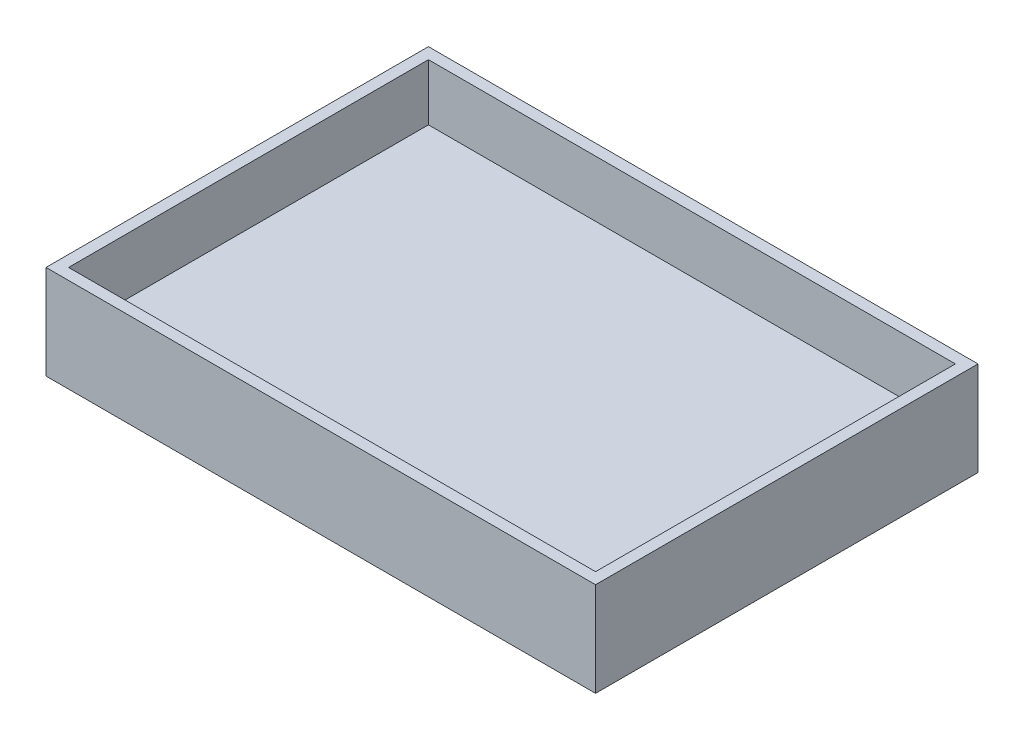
from build123d import *

# Parameters (mm, degrees)
SKETCH1_W           = 146
SKETCH1_H           = 101.6
BOSS_EXTRUDE1_DEPTH = 25
SKETCH3_W           = 140
SKETCH3_H           = 95.6
CUT_EXTRUDE1_DEPTH  = 15


with BuildPart() as part:
    # Sketch1 → Boss-Extrude1 (new body)
    with BuildSketch(Plane(origin=(0, 0, 0), x_dir=(1, 0, 0), z_dir=(0, 1, 0))):
        Rectangle(SKETCH1_W, SKETCH1_H)
    extrude(amount=BOSS_EXTRUDE1_DEPTH)

    # Sketch3 → Cut-Extrude1 (cut)
    with BuildSketch(Plane(origin=(0, 25, 0), x_dir=(1, 0, 0), z_dir=(0, 1, 0))):
        Rectangle(SKETCH3_W, SKETCH3_H)
    extrude(amount=-CUT_EXTRUDE1_DEPTH, mode=Mode.SUBTRACT)


solid = part.part
